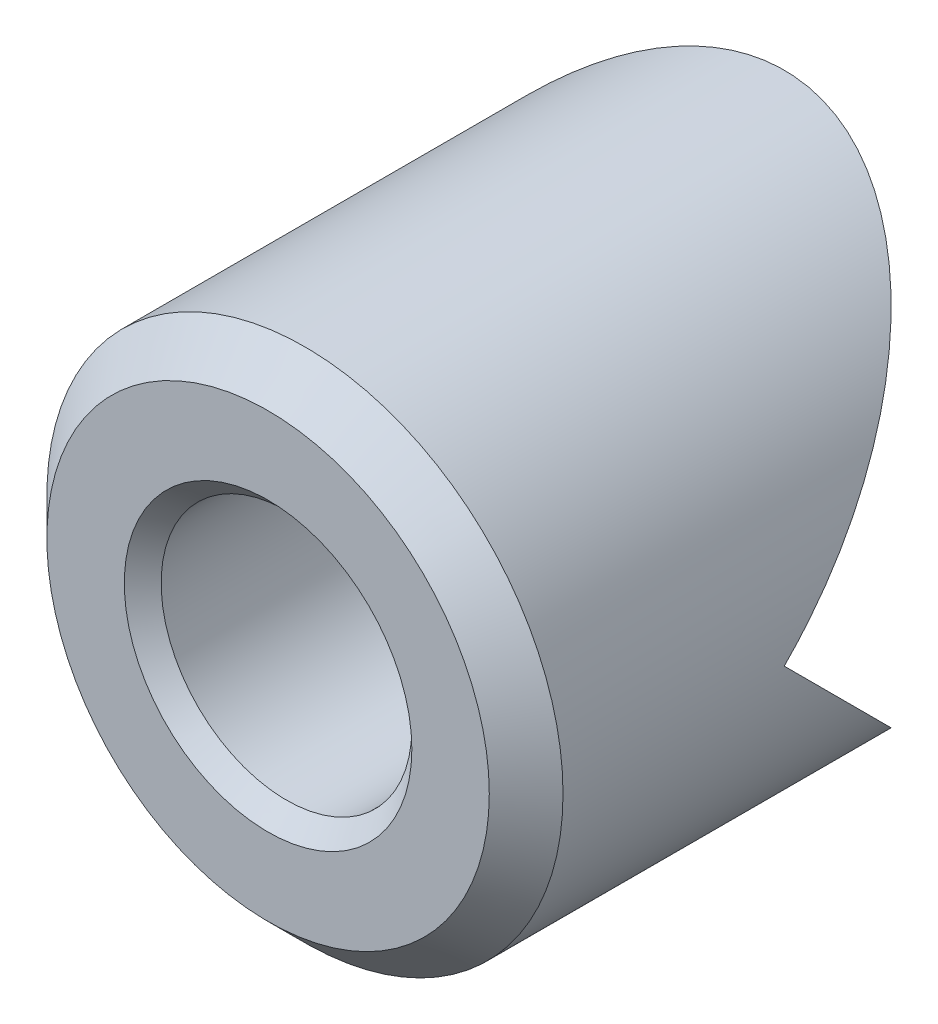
from build123d import *

# Parameters (mm, degrees)
ESQUISSE1_R                  = 7
BOSS_EXTRU_1_DEPTH           = 14
CHANFREIN1_SIZE              = 1
ENL_V_MAT_EXTRU_1_DEPTH      = 18.146428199
ENL_V_MAT_EXTRU_1_DEPTH_BACK = 18.146428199
TROU_TARAUD_M81_D            = 6.8
CHANFREIN2_SIZE              = 0.5


with BuildPart() as part:
    # Esquisse1 → Boss.-Extru.1 (new body)
    with BuildSketch(Plane.XY):
        Circle(ESQUISSE1_R)
    extrude(amount=BOSS_EXTRU_1_DEPTH)

    # Chanfrein1
    chanfrein1_edges = [part.edges().sort_by_distance(p)[0] for p in [
        (-7, 0, 14),
    ]]
    chamfer(chanfrein1_edges, length=CHANFREIN1_SIZE)

    # Esquisse2 → Enl_v. mat.-Extru.1 (cut, two sides: drawn at the far end of the back side and taken through both)
    with BuildSketch(Plane(origin=(0, 0, 0), x_dir=(0, 0, -1), z_dir=(1, 0, 0)).offset(-ENL_V_MAT_EXTRU_1_DEPTH_BACK)):
        Polygon((35.071067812, 42.071067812), (0, 7), (-7, 0), (0, -7), (35.071067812, -42.071067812), (134.267027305, -42.071067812), (134.267027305, 42.071067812), align=None)
    extrude(amount=ENL_V_MAT_EXTRU_1_DEPTH + ENL_V_MAT_EXTRU_1_DEPTH_BACK, mode=Mode.SUBTRACT)

    # Trou taraud_ M81 (through all)
    with Locations(Plane.XY.offset(14)):
        with Locations((0, 0)):
            Hole(TROU_TARAUD_M81_D / 2)

    # Chanfrein2
    chanfrein2_edges = [part.edges().sort_by_distance(p)[0] for p in [
        (3.4, 0, 14),
    ]]
    chamfer(chanfrein2_edges, length=CHANFREIN2_SIZE)


solid = part.part
